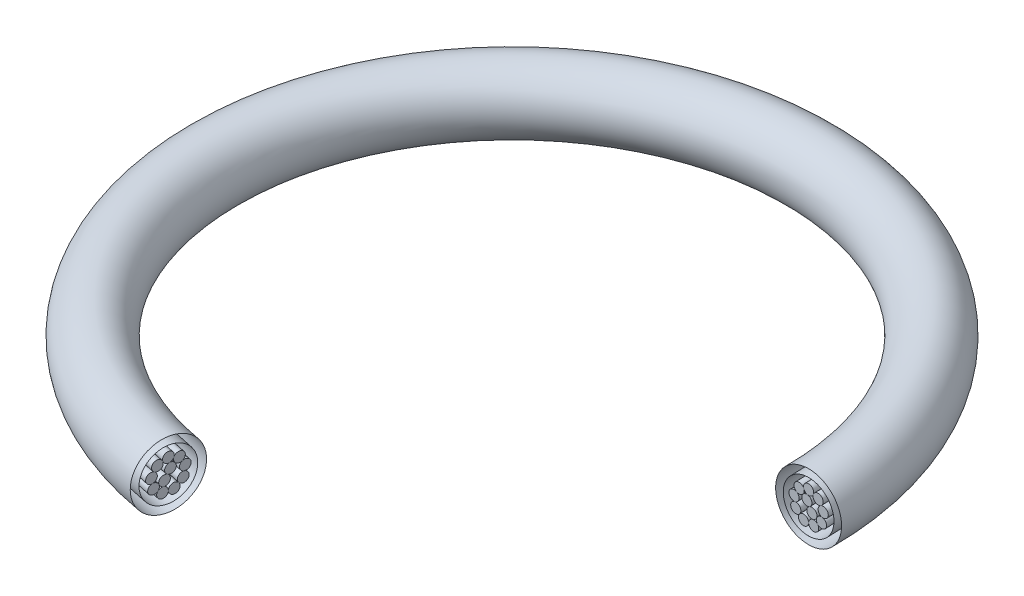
from build123d import *

# Parameters (mm, degrees)
SKETCH5_R           = 3.175
REVOLVE4_ANGLE      = 260
SKETCH6_R           = 20.6375
SKETCH6_R_2         = 20.6373984
SKETCH6_R_3         = 15.875
SKETCH6_R_4         = 15.8748984
REVOLVE_THIN2_ANGLE = 260


with BuildPart() as part:
    # Sketch5 → Revolve4 (revolve)
    with BuildSketch(Plane.XY):
        with Locations((185.7375, 9.283078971)):
            Circle(SKETCH5_R)
        with Locations((191.704548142, 7.11125106)):
            Circle(SKETCH5_R)
        with Locations((194.879548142, 1.611989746)):
            Circle(SKETCH5_R)
        with Locations((193.776882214, -4.641539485)):
            Circle(SKETCH5_R)
        with Locations((188.9125, -8.723240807)):
            Circle(SKETCH5_R)
        with Locations((182.5625, -8.723240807)):
            Circle(SKETCH5_R)
        with Locations((177.698117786, -4.641539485)):
            Circle(SKETCH5_R)
        with Locations((176.595451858, 1.611989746)):
            Circle(SKETCH5_R)
        with Locations((179.770451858, 7.11125106)):
            Circle(SKETCH5_R)
        with Locations((184.634834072, 3.029549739)):
            Circle(SKETCH5_R)
        with Locations((187.809834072, -2.469711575)):
            Circle(SKETCH5_R)
    revolve(axis=Axis((0, -55.440209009, 0), (0, 1, 0)), revolution_arc=REVOLVE4_ANGLE)


with BuildPart() as body_2:
    # Sketch6 → Revolve-Thin2 (revolve)
    # profile 1 of 2: a face of its own
    with BuildSketch(Plane.XY):
        with Locations((185.7375, 0)):
            Circle(SKETCH6_R)
        with Locations((185.7375, 0)):
            Circle(SKETCH6_R_2, mode=Mode.SUBTRACT)
    # profile 2 of 2: a face of its own
    with BuildSketch(Plane.XY):
        with Locations((185.7375, 0)):
            Circle(SKETCH6_R_3)
        with Locations((185.7375, 0)):
            Circle(SKETCH6_R_4, mode=Mode.SUBTRACT)
    revolve(axis=Axis((0, -55.440209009, 0), (0, 1, 0)), revolution_arc=REVOLVE_THIN2_ANGLE)


solid = Compound([part.part, body_2.part])
